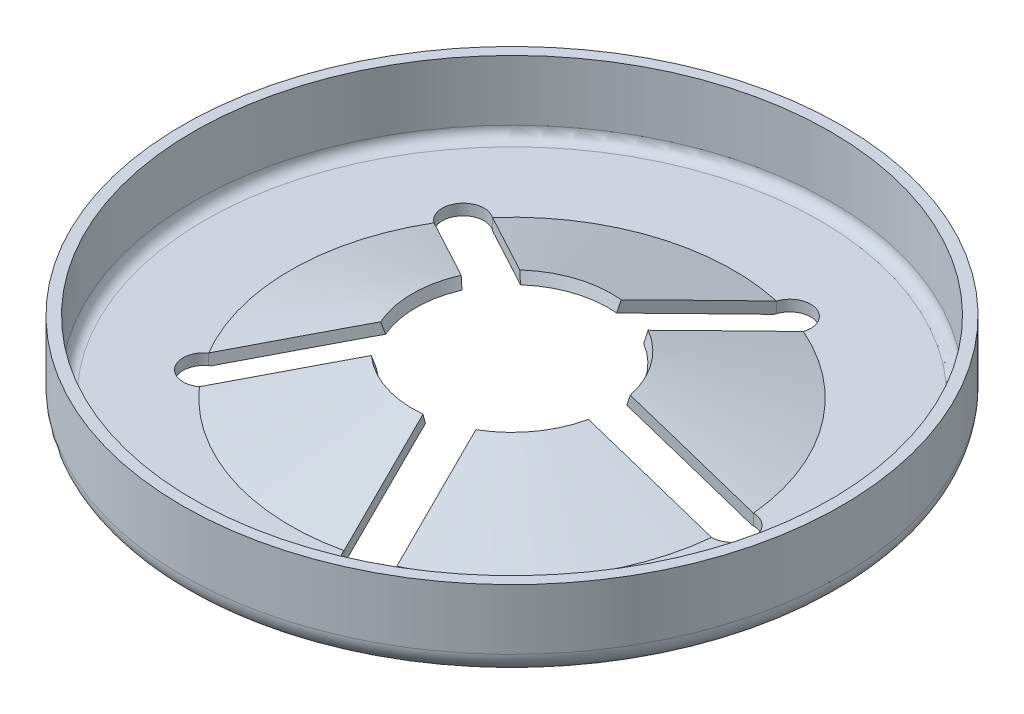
from build123d import *

# Parameters (mm, degrees)
ENL_V_MAT_EXTRU_1_DEPTH      = 9.616702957
R_P_TITION_CIRCULAIRE1_COUNT = 5


with BuildPart() as part:
    # Esquisse1 → Base-R_vol.-Mince (revolve)
    with BuildSketch(Plane.XY, mode=Mode.PRIVATE) as base_r_vol_mince_sk:
        with BuildLine():
            Line((1.75, 0.784866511), (4, 0.034866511))
            Line((4, 0.034866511), (5.599898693, 0.034866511))
            ThreePointArc((5.599898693, 0.034866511), (5.882741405, 0.152023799), (5.999898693, 0.434866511))
            Line((5.999898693, 0.434866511), (5.999898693, 1.534866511))
            Line((5.999898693, 1.534866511), (5.799898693, 1.534866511))
            Line((5.799898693, 1.534866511), (5.799898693, 0.434866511))
            ThreePointArc((5.799898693, 0.434866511), (5.741320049, 0.293445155), (5.599898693, 0.234866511))
            Line((5.599898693, 0.234866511), (4.032455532, 0.234866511))
            Line((4.032455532, 0.234866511), (1.813245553, 0.974603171))
            Line((1.813245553, 0.974603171), (1.75, 0.784866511))
        make_face()
    revolve(base_r_vol_mince_sk.sketch.rotate(Axis((0, 0, 0), (0, 1, 0)), 90), axis=Axis((0, 0, 0), (0, 1, 0)))

    # Esquisse2 → Enl_v. mat.-Extru.1 (cut, through all)
    with BuildSketch(Plane.XZ.offset(-0.034866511)):
        with BuildLine():
            Line((4.013199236, -0.381419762), (1.260343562, -0.381419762))
            Line((1.260343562, -0.381419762), (1.260343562, 0.381419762))
            Line((1.260343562, 0.381419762), (4.013199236, 0.381419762))
            ThreePointArc((4.013199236, 0.381419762), (4.394618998, 0), (4.013199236, -0.381419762))
        make_face()
    enl_v_mat_extru_1 = extrude(amount=-ENL_V_MAT_EXTRU_1_DEPTH, mode=Mode.SUBTRACT)

    # R_p_tition circulaire1: Enl_v. mat.-Extru.1 ×5 about axis
    r_p_tition_circulaire1_axis = Axis((0, 0, 0), (0, 1, 0))
    for i in range(1, R_P_TITION_CIRCULAIRE1_COUNT):
        add(enl_v_mat_extru_1.rotate(r_p_tition_circulaire1_axis, i * 360 / R_P_TITION_CIRCULAIRE1_COUNT), mode=Mode.SUBTRACT)


solid = part.part
